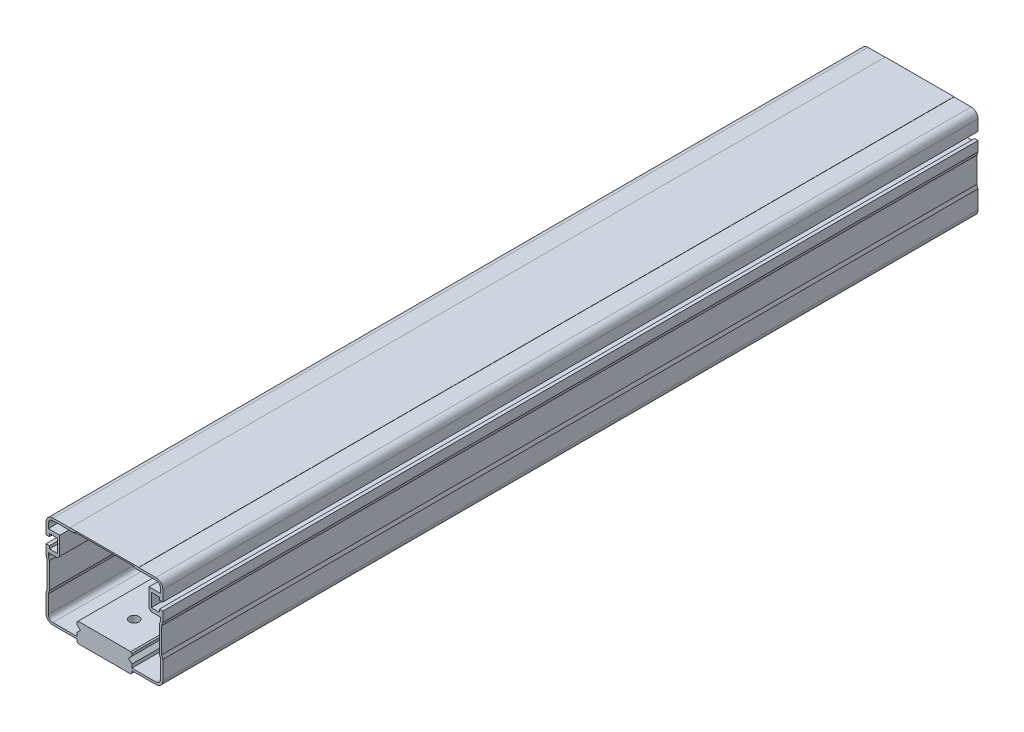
from build123d import *

# Parameters (mm, degrees)
EXTRUDE_1_DEPTH        = 356
HOLE_WIZARD_M5_2_D     = 4.2
HOLE_WIZARD_M5_2_DEPTH = 14.4
HOLE_WIZARD_M5_2_TIP   = 1.2618073


with BuildPart() as part:
    # Sketch 1 → Extrude 1 (new body)
    with BuildSketch(Plane.XY):
        with BuildLine():
            Line((22.5, 42), (15, 42))
            Line((15, 42), (15, 42.1))
            Line((15, 42.1), (-15, 42.1))
            Line((-15, 42.1), (-15, 42))
            Line((-15, 42), (-22.5, 42))
            ThreePointArc((-22.5, 42), (-24.621320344, 41.121320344), (-25.5, 39))
            Line((-25.5, 39), (-25.5, 34.2))
            Line((-25.5, 34.2), (-24, 34.2))
            Line((-24, 34.2), (-24, 35.4))
            Line((-24, 35.4), (-20.5, 35.4))
            Line((-20.5, 35.4), (-20.5, 29.6))
            Line((-20.5, 29.6), (-24, 29.6))
            Line((-24, 29.6), (-24, 30.8))
            Line((-24, 30.8), (-25.5, 30.8))
            Line((-25.5, 30.8), (-25.5, 26.5))
            Line((-25.5, 26.5), (-25, 25))
            Line((-25, 25), (-25, 14))
            Line((-25, 14), (-25.5, 12.5))
            Line((-25.5, 12.5), (-25.5, 4.5))
            ThreePointArc((-25.5, 4.5), (-24.621320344, 2.378679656), (-22.5, 1.5))
            Line((-22.5, 1.5), (-12, 1.5))
            Line((-12, 1.5), (-12, 0.5))
            Line((-12, 0.5), (-11.5, 0))
            Line((-11.5, 0), (11.5, 0))
            Line((11.5, 0), (12, 0.5))
            Line((12, 0.5), (12, 1.5))
            Line((12, 1.5), (22.5, 1.5))
            ThreePointArc((22.5, 1.5), (24.621320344, 2.378679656), (25.5, 4.5))
            Line((25.5, 4.5), (25.5, 12.5))
            Line((25.5, 12.5), (25, 14))
            Line((25, 14), (25, 25))
            Line((25, 25), (25.5, 26.5))
            Line((25.5, 26.5), (25.5, 30.8))
            Line((25.5, 30.8), (24, 30.8))
            Line((24, 30.8), (24, 29.6))
            Line((24, 29.6), (20.5, 29.6))
            Line((20.5, 29.6), (20.5, 35.4))
            Line((20.5, 35.4), (24, 35.4))
            Line((24, 35.4), (24, 34.2))
            Line((24, 34.2), (25.5, 34.2))
            Line((25.5, 34.2), (25.5, 39))
            ThreePointArc((25.5, 39), (24.621320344, 41.121320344), (22.5, 42))
        make_face()
        with BuildLine():
            Line((12, 2.5), (22.5, 2.5))
            ThreePointArc((22.5, 2.5), (23.914213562, 3.085786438), (24.5, 4.5))
            Line((24.5, 4.5), (24.5, 12.33772234))
            Line((24.5, 12.33772234), (24, 13.83772234))
            Line((24, 13.83772234), (24, 25.16227766))
            Line((24, 25.16227766), (24.5, 26.66227766))
            Line((24.5, 26.66227766), (24.5, 28))
            Line((24.5, 28), (20.5, 28))
            Line((20.5, 28), (19.5, 29))
            Line((19.5, 29), (19.5, 37))
            Line((19.5, 37), (24.5, 37))
            Line((24.5, 37), (24.5, 39))
            ThreePointArc((24.5, 39), (23.914213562, 40.414213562), (22.5, 41))
            Line((22.5, 41), (13, 41))
            Line((13, 41), (13, 41.5))
            Line((13, 41.5), (-13, 41.5))
            Line((-13, 41.5), (-13, 41))
            Line((-13, 41), (-22.5, 41))
            ThreePointArc((-22.5, 41), (-23.914213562, 40.414213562), (-24.5, 39))
            Line((-24.5, 39), (-24.5, 37))
            Line((-24.5, 37), (-19.5, 37))
            Line((-19.5, 37), (-19.5, 29))
            Line((-19.5, 29), (-20.5, 28))
            Line((-20.5, 28), (-24.5, 28))
            Line((-24.5, 28), (-24.5, 26.66227766))
            Line((-24.5, 26.66227766), (-24, 25.16227766))
            Line((-24, 25.16227766), (-24, 13.83772234))
            Line((-24, 13.83772234), (-24.5, 12.33772234))
            Line((-24.5, 12.33772234), (-24.5, 4.5))
            ThreePointArc((-24.5, 4.5), (-23.914213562, 3.085786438), (-22.5, 2.5))
            Line((-22.5, 2.5), (-12, 2.5))
            Line((-12, 2.5), (-12, 4))
            Line((-12, 4), (-10.5, 5.5))
            Line((-10.5, 5.5), (-12, 7))
            Line((-12, 7), (-12, 8))
            Line((-12, 8), (-11.5, 8.5))
            Line((-11.5, 8.5), (11.5, 8.5))
            Line((11.5, 8.5), (12, 8))
            Line((12, 8), (12, 7))
            Line((12, 7), (10.5, 5.5))
            Line((10.5, 5.5), (12, 4))
            Line((12, 4), (12, 2.5))
        make_face(mode=Mode.SUBTRACT)
    extrude(amount=EXTRUDE_1_DEPTH)

    # Hole Wizard M5 _2
    with Locations(Plane(origin=(0, 0, 0), x_dir=(-1, 0, 0), z_dir=(0, -1, 0))):
        with Locations((0, -343), (0, -303), (0, -263), (0, -223), (0, -183), (0, -143), (0, -103), (0, -63), (0, -23), (0, 17), (0, 57), (0, 97), (0, 137), (0, 177), (0, 217), (0, 257), (0, 297), (0, 337), (0, 377), (0, 417), (0, 457), (0, 537), (0, 497)):
            Hole(HOLE_WIZARD_M5_2_D / 2, depth=HOLE_WIZARD_M5_2_DEPTH)
            with Locations((0, 0, -(HOLE_WIZARD_M5_2_DEPTH + HOLE_WIZARD_M5_2_TIP / 2))):  # 118° drill point
                Cone(0, HOLE_WIZARD_M5_2_D / 2, HOLE_WIZARD_M5_2_TIP, mode=Mode.SUBTRACT)


solid = part.part
